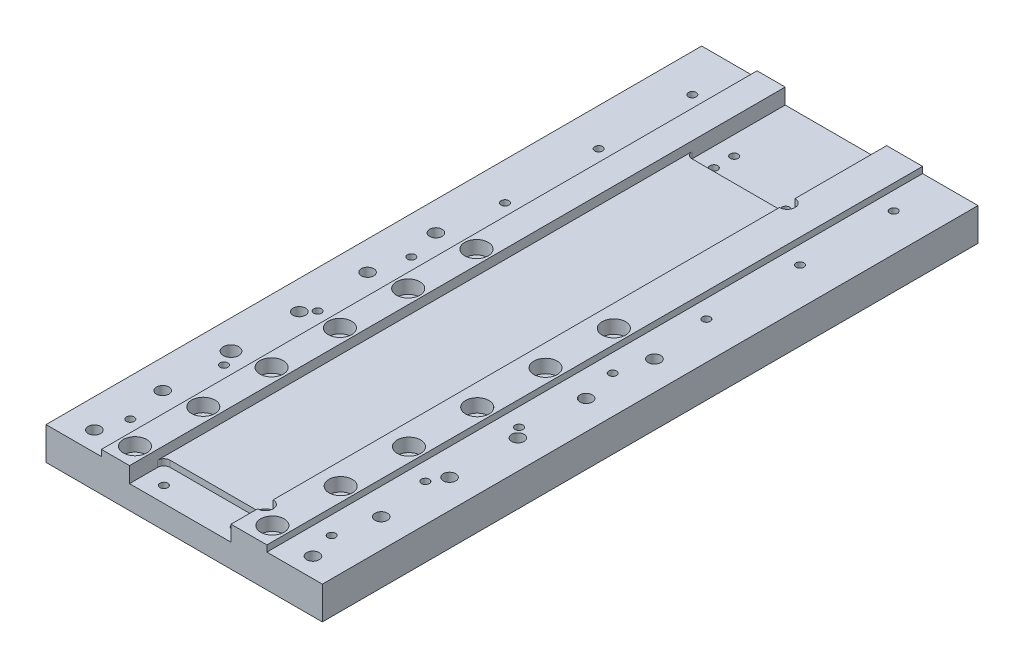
from build123d import *

# Parameters (mm, degrees)
SKIZZE1_W                                            = 177
SKIZZE1_H                                            = 25
AUFSATZ_LINEAR_AUSTRAGEN1_DEPTH                      = 420
SKIZZE2_W                                            = 35.5
SKIZZE2_H                                            = 420
SCHNITT_LINEAR_AUSTRAGEN1_DEPTH                      = 4
SKIZZE3_W                                            = 65
SKIZZE3_H                                            = 22
SCHNITT_LINEAR_AUSTRAGEN2_DEPTH                      = 10
SKIZZE4_R                                            = 5
SCHNITT_LINEAR_AUSTRAGEN3_DEPTH                      = 10
VERRUNDUNG1_R                                        = 4
SKIZZE6_W                                            = 65
SKIZZE6_H                                            = 63.7
SCHNITT_LINEAR_AUSTRAGEN4_DEPTH                      = 10
SKIZZE7_R                                            = 5
SCHNITT_LINEAR_AUSTRAGEN5_DEPTH                      = 10
VERRUNDUNG2_R                                        = 4
M6_GEWINDEBOHRUNG1_D                                 = 5
M6_GEWINDEBOHRUNG1_DEPTH                             = 19
M6_GEWINDEBOHRUNG1_TIP                               = 1.502151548
M6_GEWINDEBOHRUNG2_D                                 = 5
M6_GEWINDEBOHRUNG2_DEPTH                             = 13
M6_GEWINDEBOHRUNG2_TIP                               = 1.502151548
SKIZZE14_W                                           = 65
SKIZZE14_H                                           = 359.207349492
SCHNITT_LINEAR_AUSTRAGEN6_DEPTH                      = 6
SKIZZE15_R                                           = 4
SCHNITT_LINEAR_AUSTRAGEN7_DEPTH                      = 33
SKIZZE16_R                                           = 4
SCHNITT_LINEAR_AUSTRAGEN8_DEPTH                      = 33
STIRNSENKUNG_F_R_M8_ZYLINDERSCHRAUBE_MIT_D           = 9
STIRNSENKUNG_F_R_M8_ZYLINDERSCHRAUBE_MIT_DEPTH       = 30
STIRNSENKUNG_F_R_M8_ZYLINDERSCHRAUBE_MIT_CBORE_D     = 15
STIRNSENKUNG_F_R_M8_ZYLINDERSCHRAUBE_MIT_CBORE_DEPTH = 8.6
STIRNSENKUNG_F_R_M8_ZYLINDERSCHRAUBE_MIT_TIP         = 2.703872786
SKIZZE21_R                                           = 4
SKIZZE21_R_2                                         = 4.930809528
SCHNITT_LINEAR_AUSTRAGEN10_DEPTH                     = 187
SKIZZE22_R                                           = 4.5
SCHNITT_LINEAR_AUSTRAGEN11_DEPTH                     = 187
SKIZZE23_R                                           = 7.5
SCHNITT_LINEAR_AUSTRAGEN12_DEPTH                     = 8.6


with BuildPart() as part:
    # Skizze1 → Aufsatz-Linear austragen1 (new body)
    with BuildSketch(Plane.XY):
        with Locations((88.5, 12.5)):
            Rectangle(SKIZZE1_W, SKIZZE1_H)
    extrude(amount=AUFSATZ_LINEAR_AUSTRAGEN1_DEPTH)

    # Skizze2 → Schnitt-Linear austragen1 (cut)
    with BuildSketch(Plane(origin=(0, 25, 0), x_dir=(1, 0, 0), z_dir=(0, 1, 0))):
        with Locations((17.75, -210)):
            Rectangle(SKIZZE2_W, SKIZZE2_H)
        with Locations((159.25, -210)):
            Rectangle(SKIZZE2_W, SKIZZE2_H)
    extrude(amount=-SCHNITT_LINEAR_AUSTRAGEN1_DEPTH, mode=Mode.SUBTRACT)

    # Skizze3 → Schnitt-Linear austragen2 (cut)
    with BuildSketch(Plane(origin=(0, 25, 0), x_dir=(1, 0, 0), z_dir=(0, 1, 0))):
        with Locations((86, -409)):
            Rectangle(SKIZZE3_W, SKIZZE3_H)
    extrude(amount=-SCHNITT_LINEAR_AUSTRAGEN2_DEPTH, mode=Mode.SUBTRACT)

    # Skizze4 → Schnitt-Linear austragen3 (cut)
    with BuildSketch(Plane(origin=(0, 25, 0), x_dir=(1, 0, 0), z_dir=(0, 1, 0))):
        with Locations((118.5, -398)):
            Circle(SKIZZE4_R)
    extrude(amount=-SCHNITT_LINEAR_AUSTRAGEN3_DEPTH, mode=Mode.SUBTRACT)

    # Verrundung1
    verrundung1_edges = [part.edges().sort_by_distance(p)[0] for p in [
        (53.5, 20, 398),
    ]]
    fillet(verrundung1_edges, radius=VERRUNDUNG1_R)

    # Skizze6 → Schnitt-Linear austragen4 (cut)
    with BuildSketch(Plane(origin=(0, 25, 0), x_dir=(1, 0, 0), z_dir=(0, 1, 0))):
        with Locations((86, -31.85)):
            Rectangle(SKIZZE6_W, SKIZZE6_H)
    extrude(amount=-SCHNITT_LINEAR_AUSTRAGEN4_DEPTH, mode=Mode.SUBTRACT)

    # Skizze7 → Schnitt-Linear austragen5 (cut)
    with BuildSketch(Plane(origin=(0, 25, 0), x_dir=(1, 0, 0), z_dir=(0, 1, 0))):
        with Locations((118.5, -63.7)):
            Circle(SKIZZE7_R)
    extrude(amount=-SCHNITT_LINEAR_AUSTRAGEN5_DEPTH, mode=Mode.SUBTRACT)

    # Verrundung2
    verrundung2_edges = [part.edges().sort_by_distance(p)[0] for p in [
        (53.5, 20, 63.7),
    ]]
    fillet(verrundung2_edges, radius=VERRUNDUNG2_R)

    # M6 Gewindebohrung1
    with Locations(Plane(origin=(0, 21, 0), x_dir=(1, 0, 0), z_dir=(0, 1, 0))):
        with Locations((24, -90), (24, -30), (24, -150), (24, -210), (24, -270), (24, -330), (24, -390), (153, -390), (153, -330), (153, -270), (153, -210), (153, -150), (153, -90), (153, -30)):
            Hole(M6_GEWINDEBOHRUNG1_D / 2, depth=M6_GEWINDEBOHRUNG1_DEPTH)
            with Locations((0, 0, -(M6_GEWINDEBOHRUNG1_DEPTH + M6_GEWINDEBOHRUNG1_TIP / 2))):  # 118° drill point
                Cone(0, M6_GEWINDEBOHRUNG1_D / 2, M6_GEWINDEBOHRUNG1_TIP, mode=Mode.SUBTRACT)

    # M6 Gewindebohrung2
    with Locations(Plane(origin=(0, 15, 0), x_dir=(1, 0, 0), z_dir=(0, 1, 0))):
        with Locations((65.5, -44.7), (111.5, -44.7), (65.5, -57.7), (111.5, -57.7), (65.5, -410), (111.5, -410)):
            Hole(M6_GEWINDEBOHRUNG2_D / 2, depth=M6_GEWINDEBOHRUNG2_DEPTH)
            with Locations((0, 0, -(M6_GEWINDEBOHRUNG2_DEPTH + M6_GEWINDEBOHRUNG2_TIP / 2))):  # 118° drill point
                Cone(0, M6_GEWINDEBOHRUNG2_D / 2, M6_GEWINDEBOHRUNG2_TIP, mode=Mode.SUBTRACT)

    # Skizze14 → Schnitt-Linear austragen6 (cut)
    with BuildSketch(Plane(origin=(0, 25, 0), x_dir=(1, 0, 0), z_dir=(0, 1, 0))):
        with Locations((86, -231.896325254)):
            Rectangle(SKIZZE14_W, SKIZZE14_H)
    extrude(amount=-SCHNITT_LINEAR_AUSTRAGEN6_DEPTH, mode=Mode.SUBTRACT)

    # Skizze15 → Schnitt-Linear austragen7 (cut)
    with BuildSketch(Plane(origin=(0, 21, 0), x_dir=(1, 0, 0), z_dir=(0, 1, 0))):
        with Locations(Location((18.5, -407.5, 0), (0, 0, 270))):
            Circle(SKIZZE15_R)
        with Locations(Location((158.5, -407.5, 0), (0, 0, 270))):
            Circle(SKIZZE15_R)
    extrude(amount=-SCHNITT_LINEAR_AUSTRAGEN7_DEPTH, mode=Mode.SUBTRACT)

    # Skizze16 → Schnitt-Linear austragen8 (cut)
    with BuildSketch(Plane(origin=(0, 21, 0), x_dir=(1, 0, 0), z_dir=(0, 1, 0))):
        with Locations(Location((18.5, -232.5, 0), (0, 0, 270))):
            Circle(SKIZZE16_R)
        with Locations(Location((158.5, -232.5, 0), (0, 0, 270))):
            Circle(SKIZZE16_R)
    extrude(amount=-SCHNITT_LINEAR_AUSTRAGEN8_DEPTH, mode=Mode.SUBTRACT)

    # Stirnsenkung f_r M8 Zylinderschraube mit
    with Locations(Plane(origin=(0, 25, 0), x_dir=(1, 0, 0), z_dir=(0, 1, 0))):
        with Locations((44.5, -232.5), (44.5, -407.5), (132.5, -407.5), (132.5, -232.5)):
            CounterBoreHole(STIRNSENKUNG_F_R_M8_ZYLINDERSCHRAUBE_MIT_D / 2, STIRNSENKUNG_F_R_M8_ZYLINDERSCHRAUBE_MIT_CBORE_D / 2, STIRNSENKUNG_F_R_M8_ZYLINDERSCHRAUBE_MIT_CBORE_DEPTH, depth=STIRNSENKUNG_F_R_M8_ZYLINDERSCHRAUBE_MIT_DEPTH)
            with Locations((0, 0, -(STIRNSENKUNG_F_R_M8_ZYLINDERSCHRAUBE_MIT_DEPTH + STIRNSENKUNG_F_R_M8_ZYLINDERSCHRAUBE_MIT_TIP / 2))):  # 118° drill point
                Cone(0, STIRNSENKUNG_F_R_M8_ZYLINDERSCHRAUBE_MIT_D / 2, STIRNSENKUNG_F_R_M8_ZYLINDERSCHRAUBE_MIT_TIP, mode=Mode.SUBTRACT)

    # Skizze21 → Schnitt-Linear austragen10 (cut)
    with BuildSketch(Plane(origin=(0, 0, 0), x_dir=(-1, 0, 0), z_dir=(0, -1, 0))):
        with Locations(Location((-158.5, -276.25, 0), (0, 0, 90))):
            Circle(SKIZZE21_R)
        with Locations(Location((-158.5, -188.75, 0), (0, 0, 90))):
            Circle(SKIZZE21_R)
        with Locations(Location((-158.5, -320, 0), (0, 0, 90))):
            Circle(SKIZZE21_R)
        with Locations(Location((-18.5, -276.25, 0), (0, 0, 90))):
            Circle(SKIZZE21_R)
        with Locations(Location((-18.5, -188.75, 0), (0, 0, 90))):
            Circle(SKIZZE21_R)
        with Locations(Location((-158.5, -363.75, 0), (0, 0, 90))):
            Circle(SKIZZE21_R)
        with Locations(Location((-18.5, -320, 0), (0, 0, 90))):
            Circle(SKIZZE21_R_2)
        with Locations(Location((-18.5, -363.75, 0), (0, 0, 90))):
            Circle(SKIZZE21_R)
    extrude(amount=-SCHNITT_LINEAR_AUSTRAGEN10_DEPTH, mode=Mode.SUBTRACT)

    # Skizze22 → Schnitt-Linear austragen11 (cut)
    with BuildSketch(Plane(origin=(0, 0, 0), x_dir=(-1, 0, 0), z_dir=(0, -1, 0))):
        with BuildLine():
            ThreePointArc((-137, -188.75), (-135.681980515, -191.931980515), (-132.5, -193.25))
            Line((-132.5, -193.25), (-132.5, -188.75))
            Line((-132.5, -188.75), (-137, -188.75))
        make_face()
        with BuildLine():
            Line((-132.5, -188.75), (-132.5, -193.25))
            ThreePointArc((-132.5, -193.25), (-129.318019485, -191.931980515), (-128, -188.75))
            Line((-128, -188.75), (-132.5, -188.75))
        make_face()
        with BuildLine():
            Line((-137, -188.75), (-132.5, -188.75))
            Line((-132.5, -188.75), (-132.5, -184.25))
            ThreePointArc((-132.5, -184.25), (-135.681980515, -185.568019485), (-137, -188.75))
        make_face()
        with BuildLine():
            Line((-132.5, -184.25), (-132.5, -188.75))
            Line((-132.5, -188.75), (-128, -188.75))
            ThreePointArc((-128, -188.75), (-129.318019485, -185.568019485), (-132.5, -184.25))
        make_face()
        with BuildLine():
            ThreePointArc((-137, -188.75), (-135.681980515, -191.931980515), (-132.5, -193.25))
            Line((-132.5, -193.25), (-132.5, -188.75))
            Line((-132.5, -188.75), (-137, -188.75))
        make_face()
        with BuildLine():
            Line((-132.5, -188.75), (-132.5, -193.25))
            ThreePointArc((-132.5, -193.25), (-129.318019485, -191.931980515), (-128, -188.75))
            Line((-128, -188.75), (-132.5, -188.75))
        make_face()
        with BuildLine():
            Line((-137, -188.75), (-132.5, -188.75))
            Line((-132.5, -188.75), (-132.5, -184.25))
            ThreePointArc((-132.5, -184.25), (-135.681980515, -185.568019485), (-137, -188.75))
        make_face()
        with BuildLine():
            Line((-132.5, -184.25), (-132.5, -188.75))
            Line((-132.5, -188.75), (-128, -188.75))
            ThreePointArc((-128, -188.75), (-129.318019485, -185.568019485), (-132.5, -184.25))
        make_face()
        with BuildLine():
            ThreePointArc((-137, -188.75), (-135.681980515, -191.931980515), (-132.5, -193.25))
            Line((-132.5, -193.25), (-132.5, -188.75))
            Line((-132.5, -188.75), (-137, -188.75))
        make_face()
        with BuildLine():
            Line((-132.5, -188.75), (-132.5, -193.25))
            ThreePointArc((-132.5, -193.25), (-129.318019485, -191.931980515), (-128, -188.75))
            Line((-128, -188.75), (-132.5, -188.75))
        make_face()
        with BuildLine():
            Line((-137, -188.75), (-132.5, -188.75))
            Line((-132.5, -188.75), (-132.5, -184.25))
            ThreePointArc((-132.5, -184.25), (-135.681980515, -185.568019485), (-137, -188.75))
        make_face()
        with BuildLine():
            Line((-132.5, -184.25), (-132.5, -188.75))
            Line((-132.5, -188.75), (-128, -188.75))
            ThreePointArc((-128, -188.75), (-129.318019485, -185.568019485), (-132.5, -184.25))
        make_face()
        with BuildLine():
            ThreePointArc((-137, -188.75), (-135.681980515, -191.931980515), (-132.5, -193.25))
            Line((-132.5, -193.25), (-132.5, -188.75))
            Line((-132.5, -188.75), (-137, -188.75))
        make_face()
        with BuildLine():
            Line((-132.5, -188.75), (-132.5, -193.25))
            ThreePointArc((-132.5, -193.25), (-129.318019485, -191.931980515), (-128, -188.75))
            Line((-128, -188.75), (-132.5, -188.75))
        make_face()
        with BuildLine():
            Line((-137, -188.75), (-132.5, -188.75))
            Line((-132.5, -188.75), (-132.5, -184.25))
            ThreePointArc((-132.5, -184.25), (-135.681980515, -185.568019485), (-137, -188.75))
        make_face()
        with BuildLine():
            Line((-132.5, -184.25), (-132.5, -188.75))
            Line((-132.5, -188.75), (-128, -188.75))
            ThreePointArc((-128, -188.75), (-129.318019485, -185.568019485), (-132.5, -184.25))
        make_face()
        with Locations(Location((-44.5, -188.75, 0), (0, 0, 90))):
            Circle(SKIZZE22_R)
        with Locations(Location((-44.5, -276.25, 0), (0, 0, 90))):
            Circle(SKIZZE22_R)
        with Locations(Location((-132.5, -276.25, 0), (0, 0, 90))):
            Circle(SKIZZE22_R)
        with Locations(Location((-44.5, -320, 0), (0, 0, 90))):
            Circle(SKIZZE22_R)
        with Locations(Location((-132.5, -320, 0), (0, 0, 90))):
            Circle(SKIZZE22_R)
        with Locations(Location((-132.5, -363.75, 0), (0, 0, 90))):
            Circle(SKIZZE22_R)
        with Locations(Location((-44.5, -363.75, 0), (0, 0, 90))):
            Circle(SKIZZE22_R)
    extrude(amount=-SCHNITT_LINEAR_AUSTRAGEN11_DEPTH, mode=Mode.SUBTRACT)

    # Skizze23 → Schnitt-Linear austragen12 (cut)
    with BuildSketch(Plane(origin=(0, 25, 0), x_dir=(1, 0, 0), z_dir=(0, 1, 0))):
        with Locations(Location((44.5, -188.75, 0), (0, 0, 270))):
            Circle(SKIZZE23_R)
        with Locations(Location((132.5, -188.75, 0), (0, 0, 270))):
            Circle(SKIZZE23_R)
        with Locations(Location((132.5, -276.25, 0), (0, 0, 270))):
            Circle(SKIZZE23_R)
        with Locations(Location((132.5, -320, 0), (0, 0, 270))):
            Circle(SKIZZE23_R)
        with Locations(Location((44.5, -276.25, 0), (0, 0, 270))):
            Circle(SKIZZE23_R)
        with Locations(Location((44.5, -320, 0), (0, 0, 270))):
            Circle(SKIZZE23_R)
        with Locations(Location((44.5, -363.75, 0), (0, 0, 270))):
            Circle(SKIZZE23_R)
        with Locations(Location((132.5, -363.75, 0), (0, 0, 270))):
            Circle(SKIZZE23_R)
    extrude(amount=-SCHNITT_LINEAR_AUSTRAGEN12_DEPTH, mode=Mode.SUBTRACT)


solid = part.part
